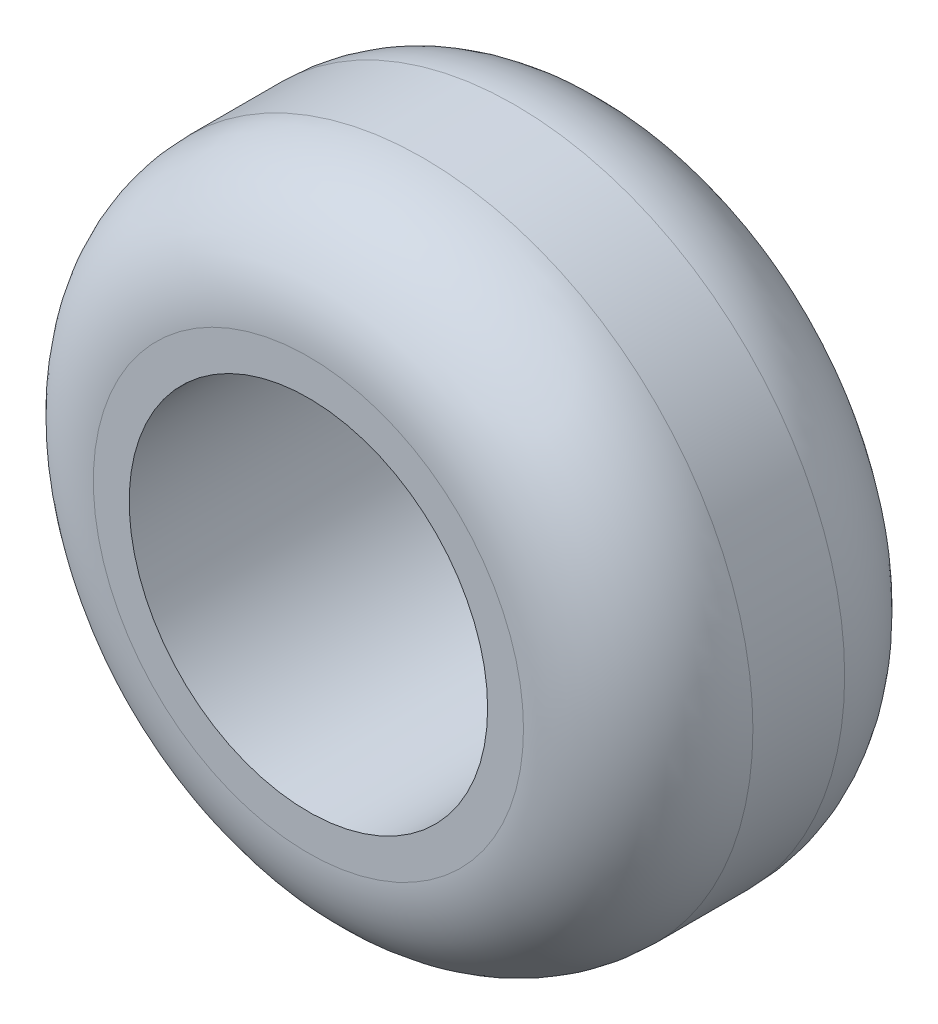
ISO-10303-21;
HEADER;
FILE_DESCRIPTION(('STEP AP214'),'2;1');
FILE_NAME('part.step','',(''),(''),'','','');
FILE_SCHEMA(('AUTOMOTIVE_DESIGN { 1 0 10303 214 1 1 1 1 }'));
ENDSEC;
DATA;
#1=APPLICATION_CONTEXT('core data for automotive mechanical design processes');
#2=APPLICATION_PROTOCOL_DEFINITION('international standard','automotive_design',2000,#1);
#3=PRODUCT_CONTEXT('',#1,'mechanical');
#4=PRODUCT('Part','Part','',(#3));
#5=PRODUCT_RELATED_PRODUCT_CATEGORY('part','',(#4));
#6=PRODUCT_DEFINITION_FORMATION('','',#4);
#7=PRODUCT_DEFINITION_CONTEXT('part definition',#1,'design');
#8=PRODUCT_DEFINITION('design','',#6,#7);
#9=PRODUCT_DEFINITION_SHAPE('','',#8);
#10=(LENGTH_UNIT() NAMED_UNIT(*) SI_UNIT(.MILLI.,.METRE.));
#11=(NAMED_UNIT(*) PLANE_ANGLE_UNIT() SI_UNIT($,.RADIAN.));
#12=(NAMED_UNIT(*) SI_UNIT($,.STERADIAN.) SOLID_ANGLE_UNIT());
#13=UNCERTAINTY_MEASURE_WITH_UNIT(LENGTH_MEASURE(1.E-05),#10,'distance_accuracy_value','');
#14=(GEOMETRIC_REPRESENTATION_CONTEXT(3) GLOBAL_UNCERTAINTY_ASSIGNED_CONTEXT((#13)) GLOBAL_UNIT_ASSIGNED_CONTEXT((#10,
#11,#12)) REPRESENTATION_CONTEXT('',''));
#15=CARTESIAN_POINT('',(0.,0.,0.));
#16=DIRECTION('',(0.,0.,1.));
#17=DIRECTION('',(1.,0.,0.));
#18=AXIS2_PLACEMENT_3D('',#15,#16,#17);
#19=CARTESIAN_POINT('',(0.,0.,112.));
#20=DIRECTION('',(0.,0.,1.));
#21=DIRECTION('',(1.,0.,0.));
#22=AXIS2_PLACEMENT_3D('',#19,#20,#21);
#23=PLANE('',#22);
#24=CARTESIAN_POINT('',(0.,0.,112.));
#25=DIRECTION('',(0.,0.,1.));
#26=DIRECTION('',(1.,0.,0.));
#27=AXIS2_PLACEMENT_3D('',#24,#25,#26);
#28=CIRCLE('',#27,75.);
#29=CARTESIAN_POINT('',(75.,0.,112.));
#30=VERTEX_POINT('',#29);
#31=EDGE_CURVE('E45',#30,#30,#28,.T.);
#32=ORIENTED_EDGE('',*,*,#31,.T.);
#33=EDGE_LOOP('',(#32));
#34=FACE_BOUND('',#33,.T.);
#35=CARTESIAN_POINT('',(0.,0.,112.));
#36=DIRECTION('',(0.,0.,1.));
#37=DIRECTION('',(1.,0.,0.));
#38=AXIS2_PLACEMENT_3D('',#35,#36,#37);
#39=CIRCLE('',#38,62.5);
#40=CARTESIAN_POINT('',(62.5,0.,112.));
#41=VERTEX_POINT('',#40);
#42=EDGE_CURVE('E50',#41,#41,#39,.T.);
#43=ORIENTED_EDGE('',*,*,#42,.F.);
#44=EDGE_LOOP('',(#43));
#45=FACE_BOUND('',#44,.T.);
#46=ADVANCED_FACE('F30',(#34,#45),#23,.T.);
#47=CARTESIAN_POINT('',(0.,0.,0.));
#48=DIRECTION('',(0.,0.,1.));
#49=DIRECTION('',(1.,0.,0.));
#50=AXIS2_PLACEMENT_3D('',#47,#48,#49);
#51=PLANE('',#50);
#52=CARTESIAN_POINT('',(0.,0.,0.));
#53=DIRECTION('',(0.,0.,1.));
#54=DIRECTION('',(1.,0.,0.));
#55=AXIS2_PLACEMENT_3D('',#52,#53,#54);
#56=CIRCLE('',#55,75.);
#57=CARTESIAN_POINT('',(75.,0.,0.));
#58=VERTEX_POINT('',#57);
#59=EDGE_CURVE('E10',#58,#58,#56,.F.);
#60=ORIENTED_EDGE('',*,*,#59,.T.);
#61=EDGE_LOOP('',(#60));
#62=FACE_BOUND('',#61,.T.);
#63=CARTESIAN_POINT('',(0.,0.,0.));
#64=DIRECTION('',(0.,0.,1.));
#65=DIRECTION('',(1.,0.,0.));
#66=AXIS2_PLACEMENT_3D('',#63,#64,#65);
#67=CIRCLE('',#66,62.5);
#68=CARTESIAN_POINT('',(62.5,0.,0.));
#69=VERTEX_POINT('',#68);
#70=EDGE_CURVE('E53',#69,#69,#67,.T.);
#71=ORIENTED_EDGE('',*,*,#70,.T.);
#72=EDGE_LOOP('',(#71));
#73=FACE_BOUND('',#72,.T.);
#74=ADVANCED_FACE('F57',(#62,#73),#51,.F.);
#75=CARTESIAN_POINT('',(0.,0.,112.));
#76=DIRECTION('',(0.,0.,-1.));
#77=DIRECTION('',(-1.,0.,0.));
#78=AXIS2_PLACEMENT_3D('',#75,#76,#77);
#79=CYLINDRICAL_SURFACE('',#78,115.);
#80=CARTESIAN_POINT('',(0.,0.,72.));
#81=DIRECTION('',(0.,0.,1.));
#82=DIRECTION('',(1.,0.,0.));
#83=AXIS2_PLACEMENT_3D('',#80,#81,#82);
#84=CIRCLE('',#83,115.);
#85=CARTESIAN_POINT('',(115.,0.,72.));
#86=VERTEX_POINT('',#85);
#87=EDGE_CURVE('E37',#86,#86,#84,.F.);
#88=ORIENTED_EDGE('',*,*,#87,.T.);
#89=EDGE_LOOP('',(#88));
#90=FACE_BOUND('',#89,.T.);
#91=CARTESIAN_POINT('',(0.,0.,40.));
#92=DIRECTION('',(0.,0.,1.));
#93=DIRECTION('',(1.,0.,0.));
#94=AXIS2_PLACEMENT_3D('',#91,#92,#93);
#95=CIRCLE('',#94,115.);
#96=CARTESIAN_POINT('',(115.,0.,40.));
#97=VERTEX_POINT('',#96);
#98=EDGE_CURVE('E41',#97,#97,#95,.T.);
#99=ORIENTED_EDGE('',*,*,#98,.T.);
#100=EDGE_LOOP('',(#99));
#101=FACE_BOUND('',#100,.T.);
#102=ADVANCED_FACE('F32',(#90,#101),#79,.T.);
#103=CARTESIAN_POINT('',(0.,0.,112.));
#104=DIRECTION('',(0.,0.,-1.));
#105=DIRECTION('',(-1.,0.,0.));
#106=AXIS2_PLACEMENT_3D('',#103,#104,#105);
#107=CYLINDRICAL_SURFACE('',#106,62.5);
#108=ORIENTED_EDGE('',*,*,#42,.T.);
#109=EDGE_LOOP('',(#108));
#110=FACE_BOUND('',#109,.T.);
#111=ORIENTED_EDGE('',*,*,#70,.F.);
#112=EDGE_LOOP('',(#111));
#113=FACE_BOUND('',#112,.T.);
#114=ADVANCED_FACE('F59',(#110,#113),#107,.F.);
#115=CARTESIAN_POINT('',(0.,0.,72.));
#116=DIRECTION('',(0.,0.,1.));
#117=DIRECTION('',(1.,0.,0.));
#118=AXIS2_PLACEMENT_3D('',#115,#116,#117);
#119=TOROIDAL_SURFACE('',#118,75.,40.);
#120=ORIENTED_EDGE('',*,*,#87,.F.);
#121=EDGE_LOOP('',(#120));
#122=FACE_BOUND('',#121,.T.);
#123=ORIENTED_EDGE('',*,*,#31,.F.);
#124=EDGE_LOOP('',(#123));
#125=FACE_BOUND('',#124,.T.);
#126=ADVANCED_FACE('F61',(#122,#125),#119,.T.);
#127=CARTESIAN_POINT('',(0.,0.,40.));
#128=DIRECTION('',(0.,0.,1.));
#129=DIRECTION('',(1.,0.,0.));
#130=AXIS2_PLACEMENT_3D('',#127,#128,#129);
#131=TOROIDAL_SURFACE('',#130,75.,40.);
#132=ORIENTED_EDGE('',*,*,#59,.F.);
#133=EDGE_LOOP('',(#132));
#134=FACE_BOUND('',#133,.T.);
#135=ORIENTED_EDGE('',*,*,#98,.F.);
#136=EDGE_LOOP('',(#135));
#137=FACE_BOUND('',#136,.T.);
#138=ADVANCED_FACE('F68',(#134,#137),#131,.T.);
#139=CLOSED_SHELL('',(#46,#74,#102,#114,#126,#138));
#140=MANIFOLD_SOLID_BREP('B2',#139);
#141=ADVANCED_BREP_SHAPE_REPRESENTATION('',(#18,#140),#14);
#142=SHAPE_DEFINITION_REPRESENTATION(#9,#141);
ENDSEC;
END-ISO-10303-21;
